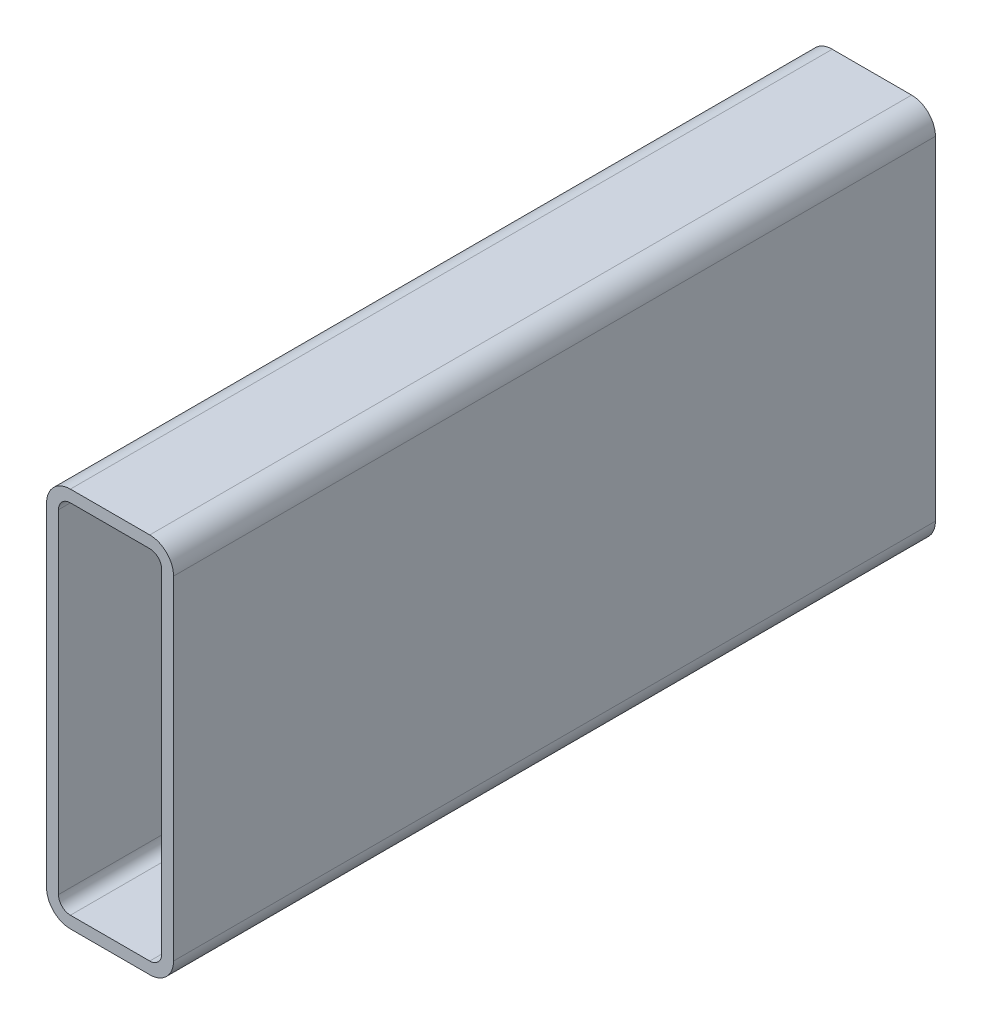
from build123d import *

# Parameters (mm, degrees)
BOSS_EXTRUDE1_DEPTH = 304.8


with BuildPart() as part:
    # Sketch1 → Boss-Extrude1 (new body)
    with BuildSketch(Plane.XY):
        with BuildLine():
            Line((9.525, 152.4), (41.275, 152.4))
            ThreePointArc((41.275, 152.4), (48.010192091, 149.610192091), (50.8, 142.875))
            Line((50.8, 142.875), (50.8, 9.525))
            ThreePointArc((50.8, 9.525), (48.010192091, 2.789807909), (41.275, 0))
            Line((41.275, 0), (9.525, 0))
            ThreePointArc((9.525, 0), (2.789807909, 2.789807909), (0, 9.525))
            Line((0, 9.525), (0, 142.875))
            ThreePointArc((0, 142.875), (2.789807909, 149.610192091), (9.525, 152.4))
        make_face()
        with BuildLine():
            Line((9.525, 147.6375), (41.275, 147.6375))
            ThreePointArc((41.275, 147.6375), (44.642596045, 146.242596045), (46.0375, 142.875))
            Line((46.0375, 142.875), (46.0375, 9.525))
            ThreePointArc((46.0375, 9.525), (44.642596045, 6.157403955), (41.275, 4.7625))
            Line((41.275, 4.7625), (9.525, 4.7625))
            ThreePointArc((9.525, 4.7625), (6.157403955, 6.157403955), (4.7625, 9.525))
            Line((4.7625, 9.525), (4.7625, 142.875))
            ThreePointArc((4.7625, 142.875), (6.157403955, 146.242596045), (9.525, 147.6375))
        make_face(mode=Mode.SUBTRACT)
    extrude(amount=BOSS_EXTRUDE1_DEPTH)


solid = part.part
